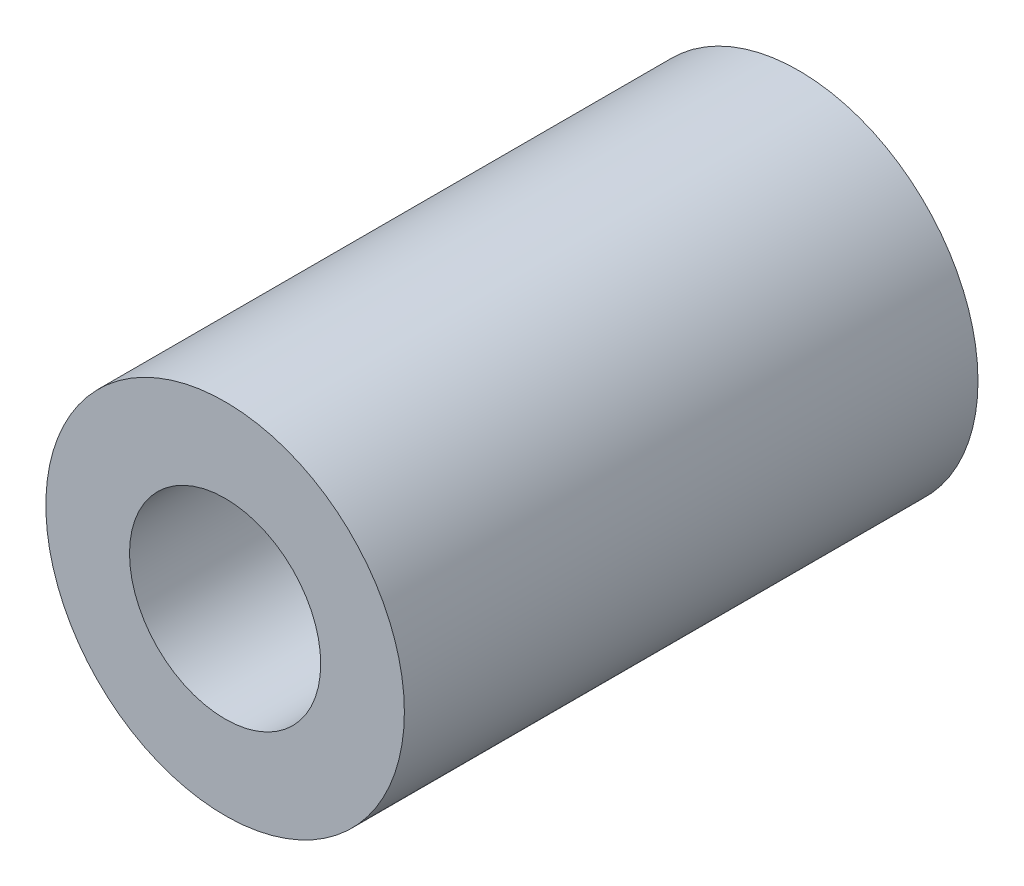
from build123d import *

# Parameters (mm, degrees)
CROQUIS1_R              = 7.5
CROQUIS1_R_2            = 4
SALIENTE_EXTRUIR1_DEPTH = 24


with BuildPart() as part:
    # Croquis1 → Saliente-Extruir1 (new body)
    with BuildSketch(Plane.XY):
        Circle(CROQUIS1_R)
        Circle(CROQUIS1_R_2, mode=Mode.SUBTRACT)
    extrude(amount=SALIENTE_EXTRUIR1_DEPTH)


solid = part.part
